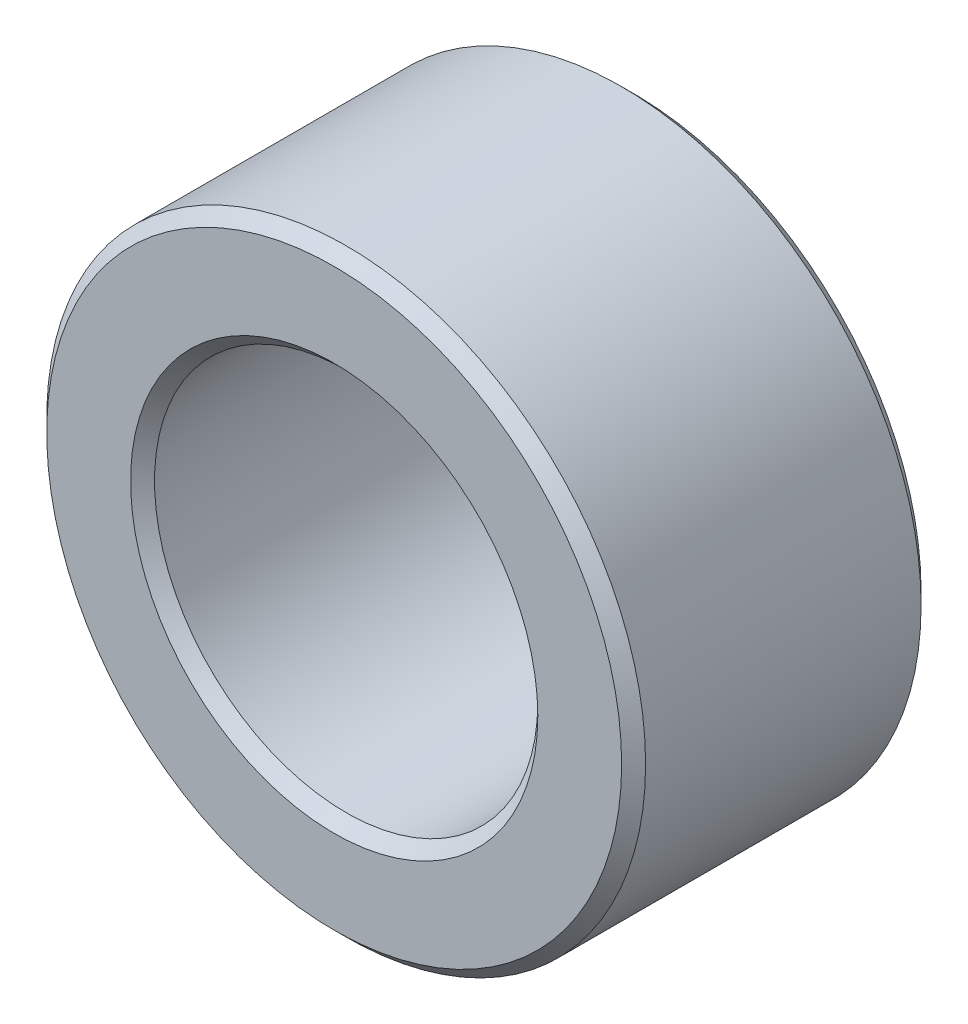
ISO-10303-21;
HEADER;
FILE_DESCRIPTION(('STEP AP214'),'2;1');
FILE_NAME('part.step','',(''),(''),'','','');
FILE_SCHEMA(('AUTOMOTIVE_DESIGN { 1 0 10303 214 1 1 1 1 }'));
ENDSEC;
DATA;
#1=APPLICATION_CONTEXT('core data for automotive mechanical design processes');
#2=APPLICATION_PROTOCOL_DEFINITION('international standard','automotive_design',2000,#1);
#3=PRODUCT_CONTEXT('',#1,'mechanical');
#4=PRODUCT('Part','Part','',(#3));
#5=PRODUCT_RELATED_PRODUCT_CATEGORY('part','',(#4));
#6=PRODUCT_DEFINITION_FORMATION('','',#4);
#7=PRODUCT_DEFINITION_CONTEXT('part definition',#1,'design');
#8=PRODUCT_DEFINITION('design','',#6,#7);
#9=PRODUCT_DEFINITION_SHAPE('','',#8);
#10=(LENGTH_UNIT() NAMED_UNIT(*) SI_UNIT(.MILLI.,.METRE.));
#11=(NAMED_UNIT(*) PLANE_ANGLE_UNIT() SI_UNIT($,.RADIAN.));
#12=(NAMED_UNIT(*) SI_UNIT($,.STERADIAN.) SOLID_ANGLE_UNIT());
#13=UNCERTAINTY_MEASURE_WITH_UNIT(LENGTH_MEASURE(1.E-05),#10,'distance_accuracy_value','');
#14=(GEOMETRIC_REPRESENTATION_CONTEXT(3) GLOBAL_UNCERTAINTY_ASSIGNED_CONTEXT((#13)) GLOBAL_UNIT_ASSIGNED_CONTEXT((#10,
#11,#12)) REPRESENTATION_CONTEXT('',''));
#15=CARTESIAN_POINT('',(0.,0.,0.));
#16=DIRECTION('',(0.,0.,1.));
#17=DIRECTION('',(1.,0.,0.));
#18=AXIS2_PLACEMENT_3D('',#15,#16,#17);
#19=CARTESIAN_POINT('',(0.,0.,2.5));
#20=DIRECTION('',(0.,0.,1.));
#21=DIRECTION('',(1.,0.,0.));
#22=AXIS2_PLACEMENT_3D('',#19,#20,#21);
#23=PLANE('',#22);
#24=CARTESIAN_POINT('',(0.,0.,2.5));
#25=DIRECTION('',(0.,0.,1.));
#26=DIRECTION('',(1.,0.,0.));
#27=AXIS2_PLACEMENT_3D('',#24,#25,#26);
#28=CIRCLE('',#27,3.4);
#29=CARTESIAN_POINT('',(3.4,0.,2.5));
#30=VERTEX_POINT('',#29);
#31=EDGE_CURVE('E10',#30,#30,#28,.F.);
#32=ORIENTED_EDGE('',*,*,#31,.T.);
#33=EDGE_LOOP('',(#32));
#34=FACE_BOUND('',#33,.T.);
#35=CARTESIAN_POINT('',(0.,0.,2.5));
#36=DIRECTION('',(0.,0.,1.));
#37=DIRECTION('',(1.,0.,0.));
#38=AXIS2_PLACEMENT_3D('',#35,#36,#37);
#39=CIRCLE('',#38,4.8);
#40=CARTESIAN_POINT('',(4.8,0.,2.5));
#41=VERTEX_POINT('',#40);
#42=EDGE_CURVE('E45',#41,#41,#39,.T.);
#43=ORIENTED_EDGE('',*,*,#42,.T.);
#44=EDGE_LOOP('',(#43));
#45=FACE_BOUND('',#44,.T.);
#46=ADVANCED_FACE('F37',(#34,#45),#23,.T.);
#47=CARTESIAN_POINT('',(0.,0.,-2.5));
#48=DIRECTION('',(0.,0.,1.));
#49=DIRECTION('',(1.,0.,0.));
#50=AXIS2_PLACEMENT_3D('',#47,#48,#49);
#51=PLANE('',#50);
#52=CARTESIAN_POINT('',(0.,0.,-2.5));
#53=DIRECTION('',(0.,0.,1.));
#54=DIRECTION('',(1.,0.,0.));
#55=AXIS2_PLACEMENT_3D('',#52,#53,#54);
#56=CIRCLE('',#55,4.8);
#57=CARTESIAN_POINT('',(4.8,0.,-2.5));
#58=VERTEX_POINT('',#57);
#59=EDGE_CURVE('E63',#58,#58,#56,.F.);
#60=ORIENTED_EDGE('',*,*,#59,.T.);
#61=EDGE_LOOP('',(#60));
#62=FACE_BOUND('',#61,.T.);
#63=CARTESIAN_POINT('',(0.,0.,-2.5));
#64=DIRECTION('',(0.,0.,1.));
#65=DIRECTION('',(1.,0.,0.));
#66=AXIS2_PLACEMENT_3D('',#63,#64,#65);
#67=CIRCLE('',#66,3.4);
#68=CARTESIAN_POINT('',(3.4,0.,-2.5));
#69=VERTEX_POINT('',#68);
#70=EDGE_CURVE('E67',#69,#69,#67,.T.);
#71=ORIENTED_EDGE('',*,*,#70,.T.);
#72=EDGE_LOOP('',(#71));
#73=FACE_BOUND('',#72,.T.);
#74=ADVANCED_FACE('F89',(#62,#73),#51,.F.);
#75=CARTESIAN_POINT('',(0.,0.,2.5));
#76=DIRECTION('',(0.,0.,-1.));
#77=DIRECTION('',(-1.,0.,0.));
#78=AXIS2_PLACEMENT_3D('',#75,#76,#77);
#79=CYLINDRICAL_SURFACE('',#78,5.);
#80=CARTESIAN_POINT('',(0.,0.,-2.3));
#81=DIRECTION('',(0.,0.,1.));
#82=DIRECTION('',(1.,0.,0.));
#83=AXIS2_PLACEMENT_3D('',#80,#81,#82);
#84=CIRCLE('',#83,5.);
#85=CARTESIAN_POINT('',(5.,0.,-2.3));
#86=VERTEX_POINT('',#85);
#87=EDGE_CURVE('E70',#86,#86,#84,.T.);
#88=ORIENTED_EDGE('',*,*,#87,.T.);
#89=EDGE_LOOP('',(#88));
#90=FACE_BOUND('',#89,.T.);
#91=CARTESIAN_POINT('',(0.,0.,2.3));
#92=DIRECTION('',(0.,0.,1.));
#93=DIRECTION('',(1.,0.,0.));
#94=AXIS2_PLACEMENT_3D('',#91,#92,#93);
#95=CIRCLE('',#94,5.);
#96=CARTESIAN_POINT('',(5.,0.,2.3));
#97=VERTEX_POINT('',#96);
#98=EDGE_CURVE('E74',#97,#97,#95,.F.);
#99=ORIENTED_EDGE('',*,*,#98,.T.);
#100=EDGE_LOOP('',(#99));
#101=FACE_BOUND('',#100,.T.);
#102=ADVANCED_FACE('F78',(#90,#101),#79,.T.);
#103=CARTESIAN_POINT('',(0.,0.,2.5));
#104=DIRECTION('',(0.,0.,-1.));
#105=DIRECTION('',(-1.,0.,0.));
#106=AXIS2_PLACEMENT_3D('',#103,#104,#105);
#107=CYLINDRICAL_SURFACE('',#106,3.2);
#108=CARTESIAN_POINT('',(0.,0.,-2.3));
#109=DIRECTION('',(0.,0.,1.));
#110=DIRECTION('',(1.,0.,0.));
#111=AXIS2_PLACEMENT_3D('',#108,#109,#110);
#112=CIRCLE('',#111,3.2);
#113=CARTESIAN_POINT('',(3.2,0.,-2.3));
#114=VERTEX_POINT('',#113);
#115=EDGE_CURVE('E51',#114,#114,#112,.F.);
#116=ORIENTED_EDGE('',*,*,#115,.T.);
#117=EDGE_LOOP('',(#116));
#118=FACE_BOUND('',#117,.T.);
#119=CARTESIAN_POINT('',(0.,0.,2.3));
#120=DIRECTION('',(0.,0.,1.));
#121=DIRECTION('',(1.,0.,0.));
#122=AXIS2_PLACEMENT_3D('',#119,#120,#121);
#123=CIRCLE('',#122,3.2);
#124=CARTESIAN_POINT('',(3.2,0.,2.3));
#125=VERTEX_POINT('',#124);
#126=EDGE_CURVE('E57',#125,#125,#123,.T.);
#127=ORIENTED_EDGE('',*,*,#126,.T.);
#128=EDGE_LOOP('',(#127));
#129=FACE_BOUND('',#128,.T.);
#130=ADVANCED_FACE('F97',(#118,#129),#107,.F.);
#131=CARTESIAN_POINT('',(0.,0.,-2.3));
#132=DIRECTION('',(0.,0.,1.));
#133=DIRECTION('',(1.,0.,0.));
#134=AXIS2_PLACEMENT_3D('',#131,#132,#133);
#135=CONICAL_SURFACE('',#134,5.,0.785398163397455);
#136=CARTESIAN_POINT('',(4.8,0.,-2.5));
#137=CARTESIAN_POINT('',(4.80208333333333,0.,-2.49791666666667));
#138=CARTESIAN_POINT('',(4.80416666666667,0.,-2.49583333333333));
#139=CARTESIAN_POINT('',(4.80833333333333,0.,-2.49166666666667));
#140=CARTESIAN_POINT('',(4.81041666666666,0.,-2.48958333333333));
#141=CARTESIAN_POINT('',(4.81458333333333,0.,-2.48541666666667));
#142=CARTESIAN_POINT('',(4.81666666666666,0.,-2.48333333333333));
#143=CARTESIAN_POINT('',(4.82083333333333,0.,-2.47916666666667));
#144=CARTESIAN_POINT('',(4.82291666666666,0.,-2.47708333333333));
#145=CARTESIAN_POINT('',(4.82708333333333,0.,-2.47291666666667));
#146=CARTESIAN_POINT('',(4.82916666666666,0.,-2.47083333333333));
#147=CARTESIAN_POINT('',(4.83333333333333,0.,-2.46666666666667));
#148=CARTESIAN_POINT('',(4.83541666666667,0.,-2.46458333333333));
#149=CARTESIAN_POINT('',(4.83958333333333,0.,-2.46041666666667));
#150=CARTESIAN_POINT('',(4.84166666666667,0.,-2.45833333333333));
#151=CARTESIAN_POINT('',(4.84583333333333,0.,-2.45416666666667));
#152=CARTESIAN_POINT('',(4.84791666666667,0.,-2.45208333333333));
#153=CARTESIAN_POINT('',(4.85208333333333,0.,-2.44791666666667));
#154=CARTESIAN_POINT('',(4.85416666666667,0.,-2.44583333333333));
#155=CARTESIAN_POINT('',(4.85833333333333,0.,-2.44166666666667));
#156=CARTESIAN_POINT('',(4.86041666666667,0.,-2.43958333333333));
#157=CARTESIAN_POINT('',(4.86458333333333,0.,-2.43541666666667));
#158=CARTESIAN_POINT('',(4.86666666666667,0.,-2.43333333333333));
#159=CARTESIAN_POINT('',(4.87083333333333,0.,-2.42916666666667));
#160=CARTESIAN_POINT('',(4.87291666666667,0.,-2.42708333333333));
#161=CARTESIAN_POINT('',(4.87708333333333,0.,-2.42291666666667));
#162=CARTESIAN_POINT('',(4.87916666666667,0.,-2.42083333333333));
#163=CARTESIAN_POINT('',(4.88333333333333,0.,-2.41666666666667));
#164=CARTESIAN_POINT('',(4.88541666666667,0.,-2.41458333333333));
#165=CARTESIAN_POINT('',(4.88958333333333,0.,-2.41041666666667));
#166=CARTESIAN_POINT('',(4.89166666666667,0.,-2.40833333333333));
#167=CARTESIAN_POINT('',(4.89583333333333,0.,-2.40416666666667));
#168=CARTESIAN_POINT('',(4.89791666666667,0.,-2.40208333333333));
#169=CARTESIAN_POINT('',(4.90208333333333,0.,-2.39791666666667));
#170=CARTESIAN_POINT('',(4.90416666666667,0.,-2.39583333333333));
#171=CARTESIAN_POINT('',(4.90833333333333,0.,-2.39166666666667));
#172=CARTESIAN_POINT('',(4.91041666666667,0.,-2.38958333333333));
#173=CARTESIAN_POINT('',(4.91458333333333,0.,-2.38541666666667));
#174=CARTESIAN_POINT('',(4.91666666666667,0.,-2.38333333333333));
#175=CARTESIAN_POINT('',(4.92083333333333,0.,-2.37916666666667));
#176=CARTESIAN_POINT('',(4.92291666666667,0.,-2.37708333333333));
#177=CARTESIAN_POINT('',(4.92708333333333,0.,-2.37291666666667));
#178=CARTESIAN_POINT('',(4.92916666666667,0.,-2.37083333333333));
#179=CARTESIAN_POINT('',(4.93333333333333,0.,-2.36666666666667));
#180=CARTESIAN_POINT('',(4.93541666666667,0.,-2.36458333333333));
#181=CARTESIAN_POINT('',(4.93958333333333,0.,-2.36041666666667));
#182=CARTESIAN_POINT('',(4.94166666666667,0.,-2.35833333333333));
#183=CARTESIAN_POINT('',(4.94583333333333,0.,-2.35416666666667));
#184=CARTESIAN_POINT('',(4.94791666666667,0.,-2.35208333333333));
#185=CARTESIAN_POINT('',(4.95208333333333,0.,-2.34791666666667));
#186=CARTESIAN_POINT('',(4.95416666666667,0.,-2.34583333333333));
#187=CARTESIAN_POINT('',(4.95833333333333,0.,-2.34166666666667));
#188=CARTESIAN_POINT('',(4.96041666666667,0.,-2.33958333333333));
#189=CARTESIAN_POINT('',(4.96458333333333,0.,-2.33541666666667));
#190=CARTESIAN_POINT('',(4.96666666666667,0.,-2.33333333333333));
#191=CARTESIAN_POINT('',(4.97083333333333,0.,-2.32916666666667));
#192=CARTESIAN_POINT('',(4.97291666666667,0.,-2.32708333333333));
#193=CARTESIAN_POINT('',(4.97708333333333,0.,-2.32291666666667));
#194=CARTESIAN_POINT('',(4.97916666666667,0.,-2.32083333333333));
#195=CARTESIAN_POINT('',(4.98333333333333,0.,-2.31666666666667));
#196=CARTESIAN_POINT('',(4.98541666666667,0.,-2.31458333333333));
#197=CARTESIAN_POINT('',(4.98958333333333,0.,-2.31041666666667));
#198=CARTESIAN_POINT('',(4.99166666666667,0.,-2.30833333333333));
#199=CARTESIAN_POINT('',(4.99583333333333,0.,-2.30416666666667));
#200=CARTESIAN_POINT('',(4.99791666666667,0.,-2.30208333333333));
#201=CARTESIAN_POINT('',(5.,0.,-2.3));
#202=B_SPLINE_CURVE_WITH_KNOTS('',3,(#136,#137,#138,#139,#140,#141,#142,#143,#144,#145,#146,
#147,#148,#149,#150,#151,#152,#153,#154,#155,#156,#157,#158,#159,#160,#161,#162,#163,#164,#165,
#166,#167,#168,#169,#170,#171,#172,#173,#174,#175,#176,#177,#178,#179,#180,#181,#182,#183,#184,
#185,#186,#187,#188,#189,#190,#191,#192,#193,#194,#195,#196,#197,#198,#199,#200,#201),
.UNSPECIFIED.,.F.,.F.,(4,2,2,2,2,2,2,2,2,2,2,2,2,2,2,2,2,2,2,2,2,2,2,2,2,2,2,2,2,2,2,2,4),(0.,
0.00883883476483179,0.0176776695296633,0.0265165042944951,0.0353553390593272,0.0441941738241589,
0.053033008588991,0.0618718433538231,0.0707106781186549,0.079549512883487,0.0883883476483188,
0.0972271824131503,0.106066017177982,0.114904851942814,0.123743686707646,0.132582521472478,
0.14142135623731,0.150260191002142,0.159099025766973,0.167937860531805,0.176776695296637,
0.185615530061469,0.194454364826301,0.203293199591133,0.212132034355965,0.220970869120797,
0.229809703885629,0.238648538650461,0.247487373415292,0.256326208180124,0.265165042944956,
0.274003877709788,0.28284271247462),.UNSPECIFIED.);
#203=EDGE_CURVE('BSEAM102',#58,#86,#202,.T.);
#204=ORIENTED_EDGE('',*,*,#59,.F.);
#205=ORIENTED_EDGE('',*,*,#87,.F.);
#206=ORIENTED_EDGE('',*,*,#203,.T.);
#207=ORIENTED_EDGE('',*,*,#203,.F.);
#208=EDGE_LOOP('',(#204,#206,#205,#207));
#209=FACE_BOUND('',#208,.T.);
#210=ADVANCED_FACE('F102',(#209),#135,.T.);
#211=CARTESIAN_POINT('',(0.,0.,-2.5));
#212=DIRECTION('',(0.,0.,-1.));
#213=DIRECTION('',(-1.,0.,0.));
#214=AXIS2_PLACEMENT_3D('',#211,#212,#213);
#215=CONICAL_SURFACE('',#214,3.4,0.785398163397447);
#216=ORIENTED_EDGE('',*,*,#115,.F.);
#217=EDGE_LOOP('',(#216));
#218=FACE_BOUND('',#217,.T.);
#219=ORIENTED_EDGE('',*,*,#70,.F.);
#220=EDGE_LOOP('',(#219));
#221=FACE_BOUND('',#220,.T.);
#222=ADVANCED_FACE('F86',(#218,#221),#215,.F.);
#223=CARTESIAN_POINT('',(0.,0.,2.3));
#224=DIRECTION('',(0.,0.,1.));
#225=DIRECTION('',(1.,0.,0.));
#226=AXIS2_PLACEMENT_3D('',#223,#224,#225);
#227=CONICAL_SURFACE('',#226,3.2,0.785398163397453);
#228=ORIENTED_EDGE('',*,*,#31,.F.);
#229=EDGE_LOOP('',(#228));
#230=FACE_BOUND('',#229,.T.);
#231=ORIENTED_EDGE('',*,*,#126,.F.);
#232=EDGE_LOOP('',(#231));
#233=FACE_BOUND('',#232,.T.);
#234=ADVANCED_FACE('F82',(#230,#233),#227,.F.);
#235=CARTESIAN_POINT('',(0.,0.,2.5));
#236=DIRECTION('',(0.,0.,-1.));
#237=DIRECTION('',(-1.,0.,0.));
#238=AXIS2_PLACEMENT_3D('',#235,#236,#237);
#239=CONICAL_SURFACE('',#238,4.8,0.785398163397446);
#240=ORIENTED_EDGE('',*,*,#98,.F.);
#241=EDGE_LOOP('',(#240));
#242=FACE_BOUND('',#241,.T.);
#243=ORIENTED_EDGE('',*,*,#42,.F.);
#244=EDGE_LOOP('',(#243));
#245=FACE_BOUND('',#244,.T.);
#246=ADVANCED_FACE('F39',(#242,#245),#239,.T.);
#247=CLOSED_SHELL('',(#46,#74,#102,#130,#210,#222,#234,#246));
#248=MANIFOLD_SOLID_BREP('B2',#247);
#249=ADVANCED_BREP_SHAPE_REPRESENTATION('',(#18,#248),#14);
#250=SHAPE_DEFINITION_REPRESENTATION(#9,#249);
ENDSEC;
END-ISO-10303-21;
